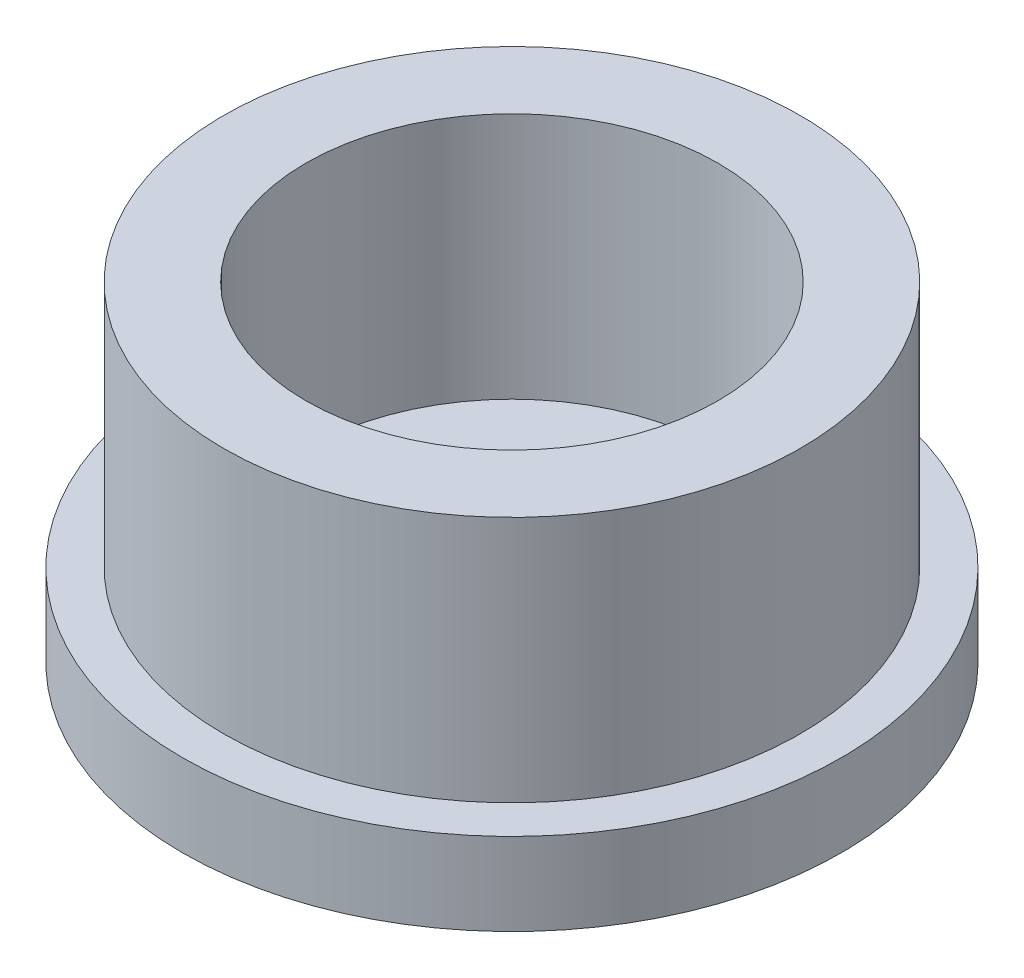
from build123d import *

# Parameters (mm, degrees)
SKETCH_1_R          = 4
EXTRUDE_1_DEPTH     = 1
SKETCH_2_R          = 1.1
CUT_EXTRUDE_1_DEPTH = 1
SKETCH_3_R          = 3.5
SKETCH_3_R_2        = 2.5
EXTRUDE_2_DEPTH     = 3


with BuildPart() as part:
    # Sketch 1 → Extrude 1 (new body)
    with BuildSketch(Plane(origin=(0, 0, 0), x_dir=(1, 0, 0), z_dir=(0, 1, 0))):
        with Locations(Location((0, 0, 0), (0, 0, 270))):
            Circle(SKETCH_1_R)
    extrude(amount=EXTRUDE_1_DEPTH)

    # Sketch 2 → Cut-Extrude 1 (cut)
    with BuildSketch(Plane(origin=(0, 1, 0), x_dir=(1, 0, 0), z_dir=(0, 1, 0))):
        with Locations(Location((0, 0, 0), (0, 0, 270))):
            Circle(SKETCH_2_R)
    extrude(amount=-CUT_EXTRUDE_1_DEPTH, mode=Mode.SUBTRACT)

    # Sketch 3 → Extrude 2 (add)
    with BuildSketch(Plane(origin=(0, 1, 0), x_dir=(1, 0, 0), z_dir=(0, 1, 0))):
        with Locations(Location((0, 0, 0), (0, 0, 270))):
            Circle(SKETCH_3_R)
        with Locations(Location((0, 0, 0), (0, 0, 270))):
            Circle(SKETCH_3_R_2, mode=Mode.SUBTRACT)
    extrude(amount=EXTRUDE_2_DEPTH)


solid = part.part
